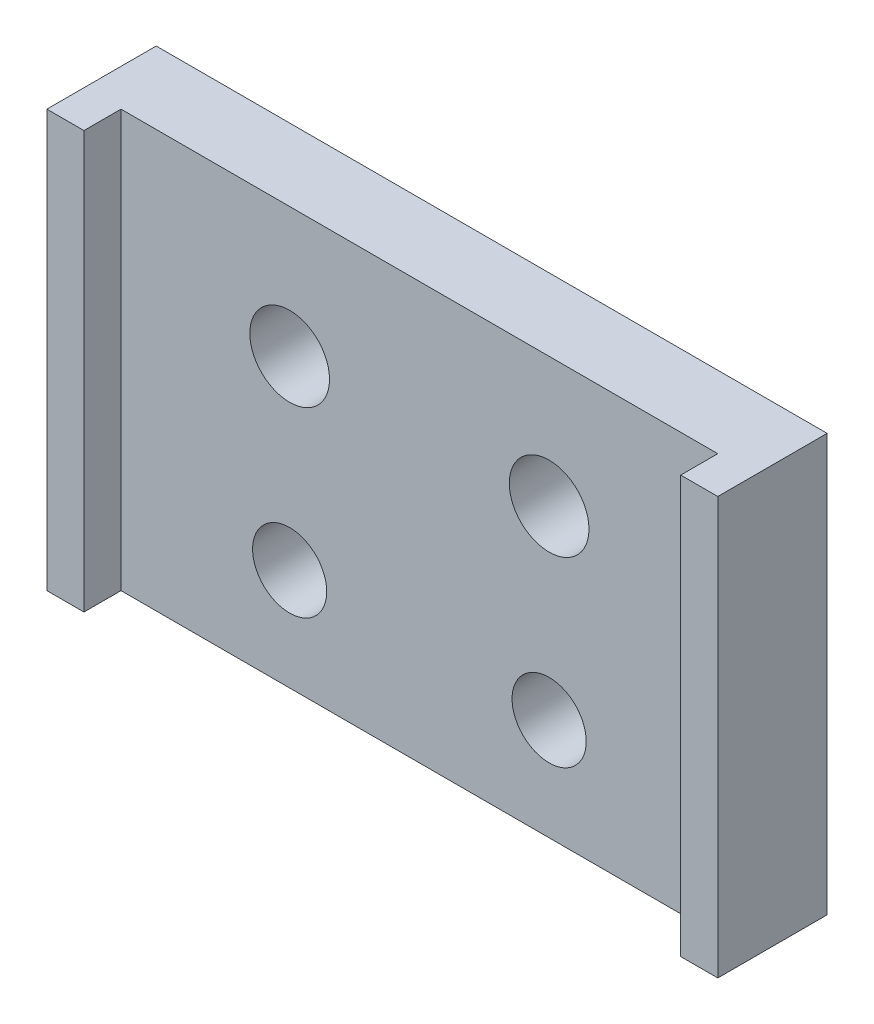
ISO-10303-21;
HEADER;
FILE_DESCRIPTION(('STEP AP214'),'2;1');
FILE_NAME('part.step','',(''),(''),'','','');
FILE_SCHEMA(('AUTOMOTIVE_DESIGN { 1 0 10303 214 1 1 1 1 }'));
ENDSEC;
DATA;
#1=APPLICATION_CONTEXT('core data for automotive mechanical design processes');
#2=APPLICATION_PROTOCOL_DEFINITION('international standard','automotive_design',2000,#1);
#3=PRODUCT_CONTEXT('',#1,'mechanical');
#4=PRODUCT('Part','Part','',(#3));
#5=PRODUCT_RELATED_PRODUCT_CATEGORY('part','',(#4));
#6=PRODUCT_DEFINITION_FORMATION('','',#4);
#7=PRODUCT_DEFINITION_CONTEXT('part definition',#1,'design');
#8=PRODUCT_DEFINITION('design','',#6,#7);
#9=PRODUCT_DEFINITION_SHAPE('','',#8);
#10=(LENGTH_UNIT() NAMED_UNIT(*) SI_UNIT(.MILLI.,.METRE.));
#11=(NAMED_UNIT(*) PLANE_ANGLE_UNIT() SI_UNIT($,.RADIAN.));
#12=(NAMED_UNIT(*) SI_UNIT($,.STERADIAN.) SOLID_ANGLE_UNIT());
#13=UNCERTAINTY_MEASURE_WITH_UNIT(LENGTH_MEASURE(1.E-05),#10,'distance_accuracy_value','');
#14=(GEOMETRIC_REPRESENTATION_CONTEXT(3) GLOBAL_UNCERTAINTY_ASSIGNED_CONTEXT((#13)) GLOBAL_UNIT_ASSIGNED_CONTEXT((#10,
#11,#12)) REPRESENTATION_CONTEXT('',''));
#15=CARTESIAN_POINT('',(0.,0.,0.));
#16=DIRECTION('',(0.,0.,1.));
#17=DIRECTION('',(1.,0.,0.));
#18=AXIS2_PLACEMENT_3D('',#15,#16,#17);
#19=CARTESIAN_POINT('',(-18.1,22.5,1.95));
#20=DIRECTION('',(0.,0.,-1.));
#21=DIRECTION('',(-1.,0.,0.));
#22=AXIS2_PLACEMENT_3D('',#19,#20,#21);
#23=PLANE('',#22);
#24=CARTESIAN_POINT('',(7.,5.49999999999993,1.95));
#25=DIRECTION('',(0.,0.,1.));
#26=DIRECTION('',(1.,0.,0.));
#27=AXIS2_PLACEMENT_3D('',#24,#25,#26);
#28=CIRCLE('',#27,2.);
#29=CARTESIAN_POINT('',(9.,5.49999999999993,1.95));
#30=VERTEX_POINT('',#29);
#31=EDGE_CURVE('E148',#30,#30,#28,.T.);
#32=ORIENTED_EDGE('',*,*,#31,.F.);
#33=EDGE_LOOP('',(#32));
#34=FACE_BOUND('',#33,.T.);
#35=CARTESIAN_POINT('',(-7.,5.49999999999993,1.95));
#36=DIRECTION('',(0.,0.,1.));
#37=DIRECTION('',(1.,0.,0.));
#38=AXIS2_PLACEMENT_3D('',#35,#36,#37);
#39=CIRCLE('',#38,2.);
#40=CARTESIAN_POINT('',(-5.,5.49999999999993,1.95));
#41=VERTEX_POINT('',#40);
#42=EDGE_CURVE('E137',#41,#41,#39,.T.);
#43=ORIENTED_EDGE('',*,*,#42,.F.);
#44=EDGE_LOOP('',(#43));
#45=FACE_BOUND('',#44,.T.);
#46=CARTESIAN_POINT('',(7.,15.5,1.95));
#47=DIRECTION('',(0.,0.,1.));
#48=DIRECTION('',(1.,0.,0.));
#49=AXIS2_PLACEMENT_3D('',#46,#47,#48);
#50=CIRCLE('',#49,2.15);
#51=CARTESIAN_POINT('',(9.15,15.5,1.95));
#52=VERTEX_POINT('',#51);
#53=EDGE_CURVE('E136',#52,#52,#50,.T.);
#54=ORIENTED_EDGE('',*,*,#53,.F.);
#55=EDGE_LOOP('',(#54));
#56=FACE_BOUND('',#55,.T.);
#57=CARTESIAN_POINT('',(-7.,15.5,1.95));
#58=DIRECTION('',(0.,0.,1.));
#59=DIRECTION('',(1.,0.,0.));
#60=AXIS2_PLACEMENT_3D('',#57,#58,#59);
#61=CIRCLE('',#60,2.15);
#62=CARTESIAN_POINT('',(-4.85,15.5,1.95));
#63=VERTEX_POINT('',#62);
#64=EDGE_CURVE('E153',#63,#63,#61,.T.);
#65=ORIENTED_EDGE('',*,*,#64,.F.);
#66=EDGE_LOOP('',(#65));
#67=FACE_BOUND('',#66,.T.);
#68=DIRECTION('',(1.,0.,0.));
#69=VECTOR('',#68,1.);
#70=CARTESIAN_POINT('',(-18.1,0.,1.95));
#71=LINE('',#70,#69);
#72=CARTESIAN_POINT('',(-16.1,0.,1.95));
#73=VERTEX_POINT('',#72);
#74=CARTESIAN_POINT('',(16.1,0.,1.95));
#75=VERTEX_POINT('',#74);
#76=EDGE_CURVE('E38',#73,#75,#71,.T.);
#77=ORIENTED_EDGE('',*,*,#76,.T.);
#78=DIRECTION('',(0.,1.,0.));
#79=VECTOR('',#78,1.);
#80=CARTESIAN_POINT('',(16.1,-2.8284271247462,1.95));
#81=LINE('',#80,#79);
#82=CARTESIAN_POINT('',(16.1,22.5,1.95));
#83=VERTEX_POINT('',#82);
#84=EDGE_CURVE('E33',#75,#83,#81,.T.);
#85=ORIENTED_EDGE('',*,*,#84,.T.);
#86=DIRECTION('',(1.,0.,0.));
#87=VECTOR('',#86,1.);
#88=CARTESIAN_POINT('',(-18.1,22.5,1.95));
#89=LINE('',#88,#87);
#90=CARTESIAN_POINT('',(-16.1,22.5,1.95));
#91=VERTEX_POINT('',#90);
#92=EDGE_CURVE('E99',#91,#83,#89,.T.);
#93=ORIENTED_EDGE('',*,*,#92,.F.);
#94=DIRECTION('',(0.,1.,0.));
#95=VECTOR('',#94,1.);
#96=CARTESIAN_POINT('',(-16.1,-2.8284271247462,1.95));
#97=LINE('',#96,#95);
#98=EDGE_CURVE('E120',#73,#91,#97,.T.);
#99=ORIENTED_EDGE('',*,*,#98,.F.);
#100=EDGE_LOOP('',(#77,#85,#93,#99));
#101=FACE_BOUND('',#100,.T.);
#102=ADVANCED_FACE('F16',(#34,#45,#56,#67,#101),#23,.F.);
#103=CARTESIAN_POINT('',(18.1,22.5,-1.95));
#104=DIRECTION('',(-1.,0.,0.));
#105=DIRECTION('',(0.,0.,1.));
#106=AXIS2_PLACEMENT_3D('',#103,#104,#105);
#107=PLANE('',#106);
#108=DIRECTION('',(0.,0.,-1.));
#109=VECTOR('',#108,1.);
#110=CARTESIAN_POINT('',(18.1,0.,-1.95));
#111=LINE('',#110,#109);
#112=CARTESIAN_POINT('',(18.1,0.,3.95));
#113=VERTEX_POINT('',#112);
#114=CARTESIAN_POINT('',(18.1,0.,-1.95));
#115=VERTEX_POINT('',#114);
#116=EDGE_CURVE('E161',#113,#115,#111,.T.);
#117=ORIENTED_EDGE('',*,*,#116,.T.);
#118=DIRECTION('',(0.,-1.,0.));
#119=VECTOR('',#118,1.);
#120=CARTESIAN_POINT('',(18.1,22.5,-1.95));
#121=LINE('',#120,#119);
#122=CARTESIAN_POINT('',(18.1,22.5,-1.95));
#123=VERTEX_POINT('',#122);
#124=EDGE_CURVE('E11',#123,#115,#121,.T.);
#125=ORIENTED_EDGE('',*,*,#124,.F.);
#126=DIRECTION('',(0.,0.,-1.));
#127=VECTOR('',#126,1.);
#128=CARTESIAN_POINT('',(18.1,22.5,-1.95));
#129=LINE('',#128,#127);
#130=CARTESIAN_POINT('',(18.1,22.5,3.95));
#131=VERTEX_POINT('',#130);
#132=EDGE_CURVE('E164',#131,#123,#129,.T.);
#133=ORIENTED_EDGE('',*,*,#132,.F.);
#134=DIRECTION('',(0.,1.,0.));
#135=VECTOR('',#134,1.);
#136=CARTESIAN_POINT('',(18.1,-2.8284271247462,3.95));
#137=LINE('',#136,#135);
#138=EDGE_CURVE('E91',#113,#131,#137,.T.);
#139=ORIENTED_EDGE('',*,*,#138,.F.);
#140=EDGE_LOOP('',(#117,#125,#133,#139));
#141=FACE_BOUND('',#140,.T.);
#142=ADVANCED_FACE('F18',(#141),#107,.F.);
#143=CARTESIAN_POINT('',(-18.1,22.5,-1.95));
#144=DIRECTION('',(0.,0.,1.));
#145=DIRECTION('',(1.,0.,0.));
#146=AXIS2_PLACEMENT_3D('',#143,#144,#145);
#147=PLANE('',#146);
#148=CARTESIAN_POINT('',(7.,5.49999999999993,-1.95));
#149=DIRECTION('',(0.,0.,1.));
#150=DIRECTION('',(1.,0.,0.));
#151=AXIS2_PLACEMENT_3D('',#148,#149,#150);
#152=CIRCLE('',#151,2.);
#153=CARTESIAN_POINT('',(9.,5.49999999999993,-1.95));
#154=VERTEX_POINT('',#153);
#155=EDGE_CURVE('E20',#154,#154,#152,.T.);
#156=ORIENTED_EDGE('',*,*,#155,.T.);
#157=EDGE_LOOP('',(#156));
#158=FACE_BOUND('',#157,.T.);
#159=CARTESIAN_POINT('',(-7.,5.49999999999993,-1.95));
#160=DIRECTION('',(0.,0.,1.));
#161=DIRECTION('',(1.,0.,0.));
#162=AXIS2_PLACEMENT_3D('',#159,#160,#161);
#163=CIRCLE('',#162,2.);
#164=CARTESIAN_POINT('',(-5.,5.49999999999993,-1.95));
#165=VERTEX_POINT('',#164);
#166=EDGE_CURVE('E134',#165,#165,#163,.T.);
#167=ORIENTED_EDGE('',*,*,#166,.T.);
#168=EDGE_LOOP('',(#167));
#169=FACE_BOUND('',#168,.T.);
#170=CARTESIAN_POINT('',(7.,15.5,-1.95));
#171=DIRECTION('',(0.,0.,1.));
#172=DIRECTION('',(1.,0.,0.));
#173=AXIS2_PLACEMENT_3D('',#170,#171,#172);
#174=CIRCLE('',#173,2.15);
#175=CARTESIAN_POINT('',(9.15,15.5,-1.95));
#176=VERTEX_POINT('',#175);
#177=EDGE_CURVE('E141',#176,#176,#174,.T.);
#178=ORIENTED_EDGE('',*,*,#177,.T.);
#179=EDGE_LOOP('',(#178));
#180=FACE_BOUND('',#179,.T.);
#181=CARTESIAN_POINT('',(-7.,15.5,-1.95));
#182=DIRECTION('',(0.,0.,1.));
#183=DIRECTION('',(1.,0.,0.));
#184=AXIS2_PLACEMENT_3D('',#181,#182,#183);
#185=CIRCLE('',#184,2.15);
#186=CARTESIAN_POINT('',(-4.85,15.5,-1.95));
#187=VERTEX_POINT('',#186);
#188=EDGE_CURVE('E100',#187,#187,#185,.T.);
#189=ORIENTED_EDGE('',*,*,#188,.T.);
#190=EDGE_LOOP('',(#189));
#191=FACE_BOUND('',#190,.T.);
#192=DIRECTION('',(-1.,0.,0.));
#193=VECTOR('',#192,1.);
#194=CARTESIAN_POINT('',(-18.1,0.,-1.95));
#195=LINE('',#194,#193);
#196=CARTESIAN_POINT('',(-18.1,0.,-1.95));
#197=VERTEX_POINT('',#196);
#198=EDGE_CURVE('E175',#115,#197,#195,.T.);
#199=ORIENTED_EDGE('',*,*,#198,.T.);
#200=DIRECTION('',(0.,-1.,0.));
#201=VECTOR('',#200,1.);
#202=CARTESIAN_POINT('',(-18.1,22.5,-1.95));
#203=LINE('',#202,#201);
#204=CARTESIAN_POINT('',(-18.1,22.5,-1.95));
#205=VERTEX_POINT('',#204);
#206=EDGE_CURVE('E25',#205,#197,#203,.T.);
#207=ORIENTED_EDGE('',*,*,#206,.F.);
#208=DIRECTION('',(-1.,0.,0.));
#209=VECTOR('',#208,1.);
#210=CARTESIAN_POINT('',(-18.1,22.5,-1.95));
#211=LINE('',#210,#209);
#212=EDGE_CURVE('E165',#123,#205,#211,.T.);
#213=ORIENTED_EDGE('',*,*,#212,.F.);
#214=ORIENTED_EDGE('',*,*,#124,.T.);
#215=EDGE_LOOP('',(#199,#207,#213,#214));
#216=FACE_BOUND('',#215,.T.);
#217=ADVANCED_FACE('F199',(#158,#169,#180,#191,#216),#147,.F.);
#218=CARTESIAN_POINT('',(-18.1,22.5,-1.95));
#219=DIRECTION('',(1.,0.,0.));
#220=DIRECTION('',(0.,0.,-1.));
#221=AXIS2_PLACEMENT_3D('',#218,#219,#220);
#222=PLANE('',#221);
#223=DIRECTION('',(0.,0.,1.));
#224=VECTOR('',#223,1.);
#225=CARTESIAN_POINT('',(-18.1,0.,-1.95));
#226=LINE('',#225,#224);
#227=CARTESIAN_POINT('',(-18.1,0.,3.95));
#228=VERTEX_POINT('',#227);
#229=EDGE_CURVE('E169',#197,#228,#226,.T.);
#230=ORIENTED_EDGE('',*,*,#229,.T.);
#231=DIRECTION('',(0.,1.,0.));
#232=VECTOR('',#231,1.);
#233=CARTESIAN_POINT('',(-18.1,-2.8284271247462,3.95));
#234=LINE('',#233,#232);
#235=CARTESIAN_POINT('',(-18.1,22.5,3.95));
#236=VERTEX_POINT('',#235);
#237=EDGE_CURVE('E128',#228,#236,#234,.T.);
#238=ORIENTED_EDGE('',*,*,#237,.T.);
#239=DIRECTION('',(0.,0.,1.));
#240=VECTOR('',#239,1.);
#241=CARTESIAN_POINT('',(-18.1,22.5,-1.95));
#242=LINE('',#241,#240);
#243=EDGE_CURVE('E167',#205,#236,#242,.T.);
#244=ORIENTED_EDGE('',*,*,#243,.F.);
#245=ORIENTED_EDGE('',*,*,#206,.T.);
#246=EDGE_LOOP('',(#230,#238,#244,#245));
#247=FACE_BOUND('',#246,.T.);
#248=ADVANCED_FACE('F185',(#247),#222,.F.);
#249=CARTESIAN_POINT('',(0.,22.5,0.));
#250=DIRECTION('',(0.,1.,0.));
#251=DIRECTION('',(0.,0.,1.));
#252=AXIS2_PLACEMENT_3D('',#249,#250,#251);
#253=PLANE('',#252);
#254=ORIENTED_EDGE('',*,*,#132,.T.);
#255=ORIENTED_EDGE('',*,*,#212,.T.);
#256=ORIENTED_EDGE('',*,*,#243,.T.);
#257=DIRECTION('',(1.,0.,0.));
#258=VECTOR('',#257,1.);
#259=CARTESIAN_POINT('',(-18.1,22.5,3.95));
#260=LINE('',#259,#258);
#261=CARTESIAN_POINT('',(-16.1,22.5,3.95));
#262=VERTEX_POINT('',#261);
#263=EDGE_CURVE('E110',#236,#262,#260,.T.);
#264=ORIENTED_EDGE('',*,*,#263,.T.);
#265=DIRECTION('',(0.,0.,-1.));
#266=VECTOR('',#265,1.);
#267=CARTESIAN_POINT('',(-16.1,22.5,1.95));
#268=LINE('',#267,#266);
#269=EDGE_CURVE('E113',#262,#91,#268,.T.);
#270=ORIENTED_EDGE('',*,*,#269,.T.);
#271=ORIENTED_EDGE('',*,*,#92,.T.);
#272=DIRECTION('',(0.,0.,1.));
#273=VECTOR('',#272,1.);
#274=CARTESIAN_POINT('',(16.1,22.5,1.95));
#275=LINE('',#274,#273);
#276=CARTESIAN_POINT('',(16.1,22.5,3.95));
#277=VERTEX_POINT('',#276);
#278=EDGE_CURVE('E86',#83,#277,#275,.T.);
#279=ORIENTED_EDGE('',*,*,#278,.T.);
#280=DIRECTION('',(1.,0.,0.));
#281=VECTOR('',#280,1.);
#282=CARTESIAN_POINT('',(18.1,22.5,3.95));
#283=LINE('',#282,#281);
#284=EDGE_CURVE('E97',#277,#131,#283,.T.);
#285=ORIENTED_EDGE('',*,*,#284,.T.);
#286=EDGE_LOOP('',(#254,#255,#256,#264,#270,#271,#279,#285));
#287=FACE_BOUND('',#286,.T.);
#288=ADVANCED_FACE('F96',(#287),#253,.T.);
#289=CARTESIAN_POINT('',(0.,0.,0.));
#290=DIRECTION('',(0.,1.,0.));
#291=DIRECTION('',(0.,0.,1.));
#292=AXIS2_PLACEMENT_3D('',#289,#290,#291);
#293=PLANE('',#292);
#294=ORIENTED_EDGE('',*,*,#116,.F.);
#295=DIRECTION('',(-1.,0.,0.));
#296=VECTOR('',#295,1.);
#297=CARTESIAN_POINT('',(18.1,0.,3.95));
#298=LINE('',#297,#296);
#299=CARTESIAN_POINT('',(16.1,0.,3.95));
#300=VERTEX_POINT('',#299);
#301=EDGE_CURVE('E114',#113,#300,#298,.T.);
#302=ORIENTED_EDGE('',*,*,#301,.T.);
#303=DIRECTION('',(0.,0.,-1.));
#304=VECTOR('',#303,1.);
#305=CARTESIAN_POINT('',(16.1,0.,1.95));
#306=LINE('',#305,#304);
#307=EDGE_CURVE('E87',#300,#75,#306,.T.);
#308=ORIENTED_EDGE('',*,*,#307,.T.);
#309=ORIENTED_EDGE('',*,*,#76,.F.);
#310=DIRECTION('',(0.,0.,1.));
#311=VECTOR('',#310,1.);
#312=CARTESIAN_POINT('',(-16.1,0.,1.95));
#313=LINE('',#312,#311);
#314=CARTESIAN_POINT('',(-16.1,0.,3.95));
#315=VERTEX_POINT('',#314);
#316=EDGE_CURVE('E124',#73,#315,#313,.T.);
#317=ORIENTED_EDGE('',*,*,#316,.T.);
#318=DIRECTION('',(-1.,0.,0.));
#319=VECTOR('',#318,1.);
#320=CARTESIAN_POINT('',(-18.1,0.,3.95));
#321=LINE('',#320,#319);
#322=EDGE_CURVE('E132',#315,#228,#321,.T.);
#323=ORIENTED_EDGE('',*,*,#322,.T.);
#324=ORIENTED_EDGE('',*,*,#229,.F.);
#325=ORIENTED_EDGE('',*,*,#198,.F.);
#326=EDGE_LOOP('',(#294,#302,#308,#309,#317,#323,#324,#325));
#327=FACE_BOUND('',#326,.T.);
#328=ADVANCED_FACE('F159',(#327),#293,.F.);
#329=CARTESIAN_POINT('',(-16.1,-2.8284271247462,1.95));
#330=DIRECTION('',(1.,0.,0.));
#331=DIRECTION('',(0.,0.,-1.));
#332=AXIS2_PLACEMENT_3D('',#329,#330,#331);
#333=PLANE('',#332);
#334=ORIENTED_EDGE('',*,*,#316,.F.);
#335=ORIENTED_EDGE('',*,*,#98,.T.);
#336=ORIENTED_EDGE('',*,*,#269,.F.);
#337=DIRECTION('',(0.,1.,0.));
#338=VECTOR('',#337,1.);
#339=CARTESIAN_POINT('',(-16.1,-2.8284271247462,3.95));
#340=LINE('',#339,#338);
#341=EDGE_CURVE('E117',#315,#262,#340,.T.);
#342=ORIENTED_EDGE('',*,*,#341,.F.);
#343=EDGE_LOOP('',(#334,#335,#336,#342));
#344=FACE_BOUND('',#343,.T.);
#345=ADVANCED_FACE('F198',(#344),#333,.T.);
#346=CARTESIAN_POINT('',(-18.1,-2.8284271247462,3.95));
#347=DIRECTION('',(0.,0.,1.));
#348=DIRECTION('',(1.,0.,0.));
#349=AXIS2_PLACEMENT_3D('',#346,#347,#348);
#350=PLANE('',#349);
#351=ORIENTED_EDGE('',*,*,#322,.F.);
#352=ORIENTED_EDGE('',*,*,#341,.T.);
#353=ORIENTED_EDGE('',*,*,#263,.F.);
#354=ORIENTED_EDGE('',*,*,#237,.F.);
#355=EDGE_LOOP('',(#351,#352,#353,#354));
#356=FACE_BOUND('',#355,.T.);
#357=ADVANCED_FACE('F195',(#356),#350,.T.);
#358=CARTESIAN_POINT('',(18.1,-2.8284271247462,3.95));
#359=DIRECTION('',(0.,0.,1.));
#360=DIRECTION('',(1.,0.,0.));
#361=AXIS2_PLACEMENT_3D('',#358,#359,#360);
#362=PLANE('',#361);
#363=ORIENTED_EDGE('',*,*,#301,.F.);
#364=ORIENTED_EDGE('',*,*,#138,.T.);
#365=ORIENTED_EDGE('',*,*,#284,.F.);
#366=DIRECTION('',(0.,1.,0.));
#367=VECTOR('',#366,1.);
#368=CARTESIAN_POINT('',(16.1,-2.8284271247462,3.95));
#369=LINE('',#368,#367);
#370=EDGE_CURVE('E83',#300,#277,#369,.T.);
#371=ORIENTED_EDGE('',*,*,#370,.F.);
#372=EDGE_LOOP('',(#363,#364,#365,#371));
#373=FACE_BOUND('',#372,.T.);
#374=ADVANCED_FACE('F103',(#373),#362,.T.);
#375=CARTESIAN_POINT('',(16.1,-2.8284271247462,1.95));
#376=DIRECTION('',(-1.,0.,0.));
#377=DIRECTION('',(0.,0.,1.));
#378=AXIS2_PLACEMENT_3D('',#375,#376,#377);
#379=PLANE('',#378);
#380=ORIENTED_EDGE('',*,*,#307,.F.);
#381=ORIENTED_EDGE('',*,*,#370,.T.);
#382=ORIENTED_EDGE('',*,*,#278,.F.);
#383=ORIENTED_EDGE('',*,*,#84,.F.);
#384=EDGE_LOOP('',(#380,#381,#382,#383));
#385=FACE_BOUND('',#384,.T.);
#386=ADVANCED_FACE('F85',(#385),#379,.T.);
#387=CARTESIAN_POINT('',(-7.,15.5,1.95));
#388=DIRECTION('',(0.,0.,1.));
#389=DIRECTION('',(1.,0.,0.));
#390=AXIS2_PLACEMENT_3D('',#387,#388,#389);
#391=CYLINDRICAL_SURFACE('',#390,2.15);
#392=ORIENTED_EDGE('',*,*,#188,.F.);
#393=EDGE_LOOP('',(#392));
#394=FACE_BOUND('',#393,.T.);
#395=ORIENTED_EDGE('',*,*,#64,.T.);
#396=EDGE_LOOP('',(#395));
#397=FACE_BOUND('',#396,.T.);
#398=ADVANCED_FACE('F228',(#394,#397),#391,.F.);
#399=CARTESIAN_POINT('',(7.,15.5,1.95));
#400=DIRECTION('',(0.,0.,1.));
#401=DIRECTION('',(1.,0.,0.));
#402=AXIS2_PLACEMENT_3D('',#399,#400,#401);
#403=CYLINDRICAL_SURFACE('',#402,2.15);
#404=ORIENTED_EDGE('',*,*,#177,.F.);
#405=EDGE_LOOP('',(#404));
#406=FACE_BOUND('',#405,.T.);
#407=ORIENTED_EDGE('',*,*,#53,.T.);
#408=EDGE_LOOP('',(#407));
#409=FACE_BOUND('',#408,.T.);
#410=ADVANCED_FACE('F233',(#406,#409),#403,.F.);
#411=CARTESIAN_POINT('',(-7.,5.49999999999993,-8.05));
#412=DIRECTION('',(0.,0.,1.));
#413=DIRECTION('',(1.,0.,0.));
#414=AXIS2_PLACEMENT_3D('',#411,#412,#413);
#415=CYLINDRICAL_SURFACE('',#414,2.);
#416=ORIENTED_EDGE('',*,*,#42,.T.);
#417=EDGE_LOOP('',(#416));
#418=FACE_BOUND('',#417,.T.);
#419=ORIENTED_EDGE('',*,*,#166,.F.);
#420=EDGE_LOOP('',(#419));
#421=FACE_BOUND('',#420,.T.);
#422=ADVANCED_FACE('F237',(#418,#421),#415,.F.);
#423=CARTESIAN_POINT('',(7.,5.49999999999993,-8.05));
#424=DIRECTION('',(0.,0.,1.));
#425=DIRECTION('',(1.,0.,0.));
#426=AXIS2_PLACEMENT_3D('',#423,#424,#425);
#427=CYLINDRICAL_SURFACE('',#426,2.);
#428=ORIENTED_EDGE('',*,*,#31,.T.);
#429=EDGE_LOOP('',(#428));
#430=FACE_BOUND('',#429,.T.);
#431=ORIENTED_EDGE('',*,*,#155,.F.);
#432=EDGE_LOOP('',(#431));
#433=FACE_BOUND('',#432,.T.);
#434=ADVANCED_FACE('F241',(#430,#433),#427,.F.);
#435=CLOSED_SHELL('',(#102,#142,#217,#248,#288,#328,#345,#357,#374,#386,#398,#410,#422,#434));
#436=MANIFOLD_SOLID_BREP('B1',#435);
#437=ADVANCED_BREP_SHAPE_REPRESENTATION('',(#18,#436),#14);
#438=SHAPE_DEFINITION_REPRESENTATION(#9,#437);
ENDSEC;
END-ISO-10303-21;
